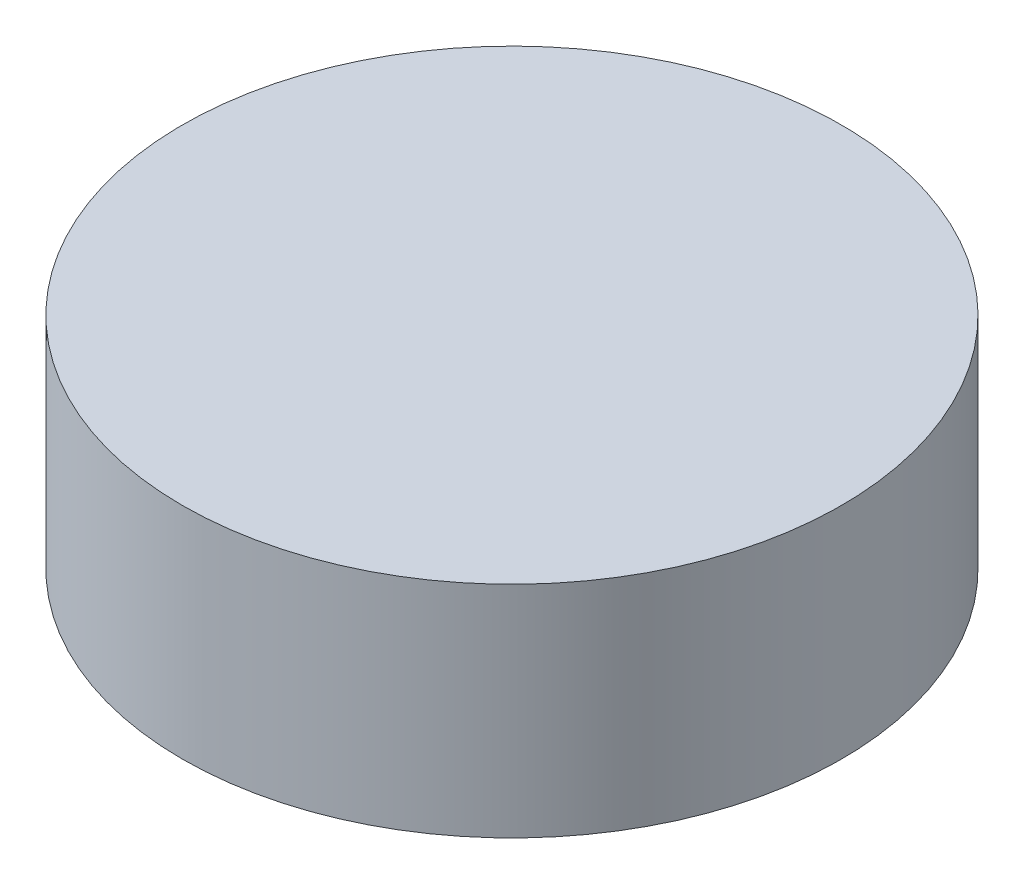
ISO-10303-21;
HEADER;
FILE_DESCRIPTION(('STEP AP214'),'2;1');
FILE_NAME('part.step','',(''),(''),'','','');
FILE_SCHEMA(('AUTOMOTIVE_DESIGN { 1 0 10303 214 1 1 1 1 }'));
ENDSEC;
DATA;
#1=APPLICATION_CONTEXT('core data for automotive mechanical design processes');
#2=APPLICATION_PROTOCOL_DEFINITION('international standard','automotive_design',2000,#1);
#3=PRODUCT_CONTEXT('',#1,'mechanical');
#4=PRODUCT('Part','Part','',(#3));
#5=PRODUCT_RELATED_PRODUCT_CATEGORY('part','',(#4));
#6=PRODUCT_DEFINITION_FORMATION('','',#4);
#7=PRODUCT_DEFINITION_CONTEXT('part definition',#1,'design');
#8=PRODUCT_DEFINITION('design','',#6,#7);
#9=PRODUCT_DEFINITION_SHAPE('','',#8);
#10=(LENGTH_UNIT() NAMED_UNIT(*) SI_UNIT(.MILLI.,.METRE.));
#11=(NAMED_UNIT(*) PLANE_ANGLE_UNIT() SI_UNIT($,.RADIAN.));
#12=(NAMED_UNIT(*) SI_UNIT($,.STERADIAN.) SOLID_ANGLE_UNIT());
#13=UNCERTAINTY_MEASURE_WITH_UNIT(LENGTH_MEASURE(1.E-05),#10,'distance_accuracy_value','');
#14=(GEOMETRIC_REPRESENTATION_CONTEXT(3) GLOBAL_UNCERTAINTY_ASSIGNED_CONTEXT((#13)) GLOBAL_UNIT_ASSIGNED_CONTEXT((#10,
#11,#12)) REPRESENTATION_CONTEXT('',''));
#15=CARTESIAN_POINT('',(0.,0.,0.));
#16=DIRECTION('',(0.,0.,1.));
#17=DIRECTION('',(1.,0.,0.));
#18=AXIS2_PLACEMENT_3D('',#15,#16,#17);
#19=CARTESIAN_POINT('',(0.,0.5,0.));
#20=DIRECTION('',(0.,-1.,0.));
#21=DIRECTION('',(0.,0.,-1.));
#22=AXIS2_PLACEMENT_3D('',#19,#20,#21);
#23=CYLINDRICAL_SURFACE('',#22,0.75);
#24=CARTESIAN_POINT('',(0.,0.5,0.));
#25=DIRECTION('',(0.,1.,0.));
#26=DIRECTION('',(0.,0.,1.));
#27=AXIS2_PLACEMENT_3D('',#24,#25,#26);
#28=CIRCLE('',#27,0.75);
#29=CARTESIAN_POINT('',(0.,0.5,0.75));
#30=VERTEX_POINT('',#29);
#31=EDGE_CURVE('E10',#30,#30,#28,.T.);
#32=ORIENTED_EDGE('',*,*,#31,.F.);
#33=EDGE_LOOP('',(#32));
#34=FACE_BOUND('',#33,.T.);
#35=CARTESIAN_POINT('',(0.,0.,0.));
#36=DIRECTION('',(0.,1.,0.));
#37=DIRECTION('',(0.,0.,1.));
#38=AXIS2_PLACEMENT_3D('',#35,#36,#37);
#39=CIRCLE('',#38,0.75);
#40=CARTESIAN_POINT('',(0.,0.,0.75));
#41=VERTEX_POINT('',#40);
#42=EDGE_CURVE('E36',#41,#41,#39,.T.);
#43=ORIENTED_EDGE('',*,*,#42,.T.);
#44=EDGE_LOOP('',(#43));
#45=FACE_BOUND('',#44,.T.);
#46=ADVANCED_FACE('F33',(#34,#45),#23,.T.);
#47=CARTESIAN_POINT('',(0.,0.5,0.));
#48=DIRECTION('',(0.,1.,0.));
#49=DIRECTION('',(0.,0.,1.));
#50=AXIS2_PLACEMENT_3D('',#47,#48,#49);
#51=PLANE('',#50);
#52=ORIENTED_EDGE('',*,*,#31,.T.);
#53=EDGE_LOOP('',(#52));
#54=FACE_BOUND('',#53,.T.);
#55=ADVANCED_FACE('F48',(#54),#51,.T.);
#56=CARTESIAN_POINT('',(0.,0.,0.));
#57=DIRECTION('',(0.,1.,0.));
#58=DIRECTION('',(0.,0.,1.));
#59=AXIS2_PLACEMENT_3D('',#56,#57,#58);
#60=PLANE('',#59);
#61=ORIENTED_EDGE('',*,*,#42,.F.);
#62=EDGE_LOOP('',(#61));
#63=FACE_BOUND('',#62,.T.);
#64=ADVANCED_FACE('F46',(#63),#60,.F.);
#65=CLOSED_SHELL('',(#46,#55,#64));
#66=MANIFOLD_SOLID_BREP('B2',#65);
#67=ADVANCED_BREP_SHAPE_REPRESENTATION('',(#18,#66),#14);
#68=SHAPE_DEFINITION_REPRESENTATION(#9,#67);
ENDSEC;
END-ISO-10303-21;
